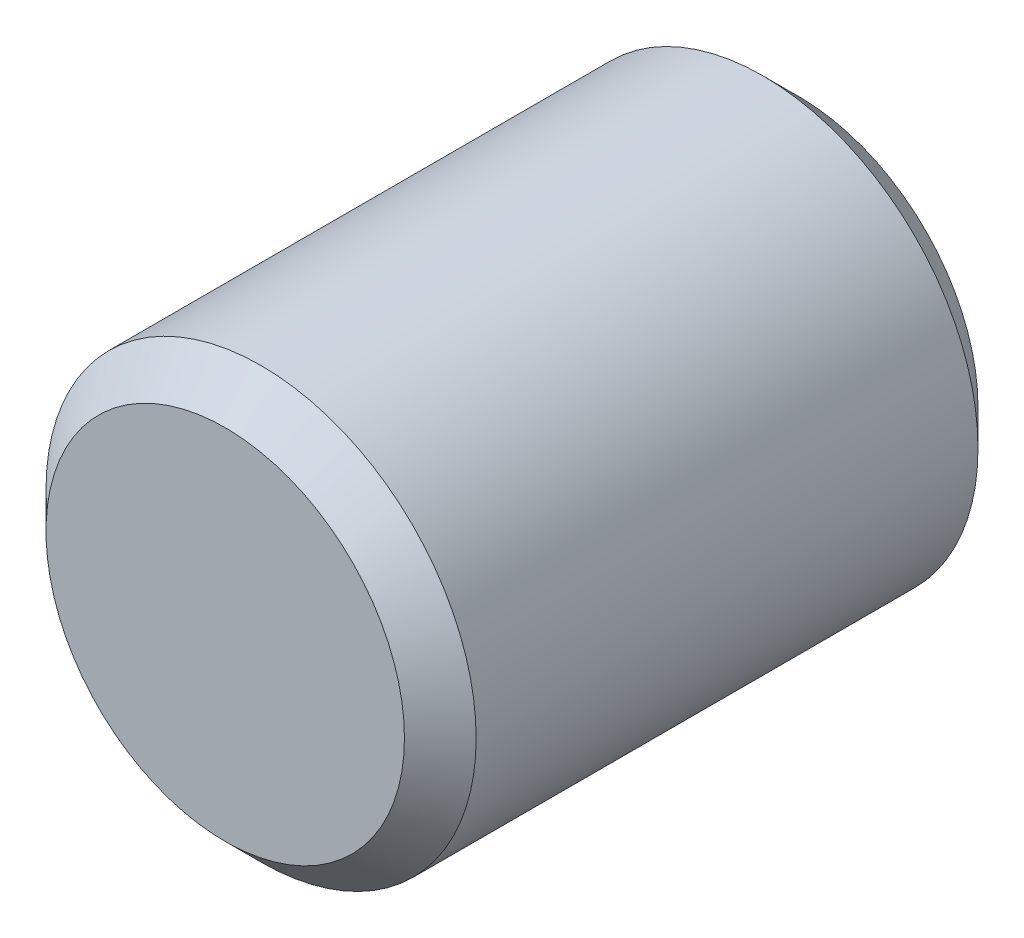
from build123d import *

# Parameters (mm, degrees)
ESQUISSE1_R          = 6
BASE_EXTRUSION_DEPTH = 16
CHANFREIN1_SIZE      = 1


with BuildPart() as part:
    # Esquisse1 → Base-Extrusion (new body)
    with BuildSketch(Plane.XY):
        Circle(ESQUISSE1_R)
    extrude(amount=BASE_EXTRUSION_DEPTH)

    # Chanfrein1
    chanfrein1_edges = [part.edges().sort_by_distance(p)[0] for p in [
        (-6, 0, 0),
        (-6, 0, 16),
    ]]
    chamfer(chanfrein1_edges, length=CHANFREIN1_SIZE)


solid = part.part
